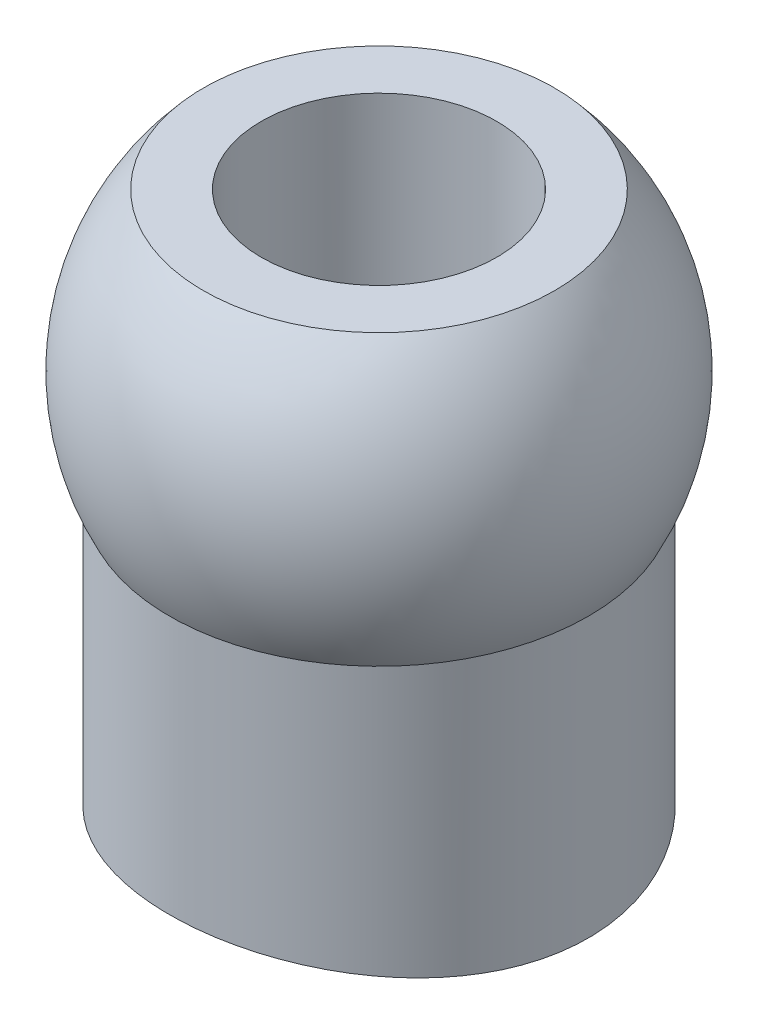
from build123d import *

# Parameters (mm, degrees)
ENL_V_MAT_EXTRU_1_DEPTH      = 10.748354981
ENL_V_MAT_EXTRU_1_DEPTH_BACK = 10.748354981
ESQUISSE2_R                  = 21
D_GAGEMENT_M41_D             = 4.5


with BuildPart() as part:
    # Esquisse1 → R_volution1 (revolve)
    with BuildSketch(Plane.XY):
        with BuildLine():
            Line((0, 3), (3.354101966, 3))
            ThreePointArc((3.354101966, 3), (4.463802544, 0.569619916), (4, -2.061552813))
            Line((4, -2.061552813), (4, -7.384471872))
            Line((4, -7.384471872), (0, -7.384471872))
            Line((0, -7.384471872), (0, 3))
        make_face()
    revolve(axis=Axis((0, 52.870893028, 0), (0, -1, 0)))

    # Esquisse2 → Enl_v. mat.-Extru.1 (cut, two sides: drawn at the far end of the back side and taken through both)
    with BuildSketch(Plane.XY.offset(-ENL_V_MAT_EXTRU_1_DEPTH_BACK)):
        with Locations((0, -28)):
            Circle(ESQUISSE2_R)
    extrude(amount=ENL_V_MAT_EXTRU_1_DEPTH + ENL_V_MAT_EXTRU_1_DEPTH_BACK, mode=Mode.SUBTRACT)

    # D_gagement M41 (through all)
    with Locations(Plane(origin=(0, 3, 0), x_dir=(-1, 0, 0), z_dir=(0, 1, 0))):
        with Locations((0, 0)):
            Hole(D_GAGEMENT_M41_D / 2)


solid = part.part
